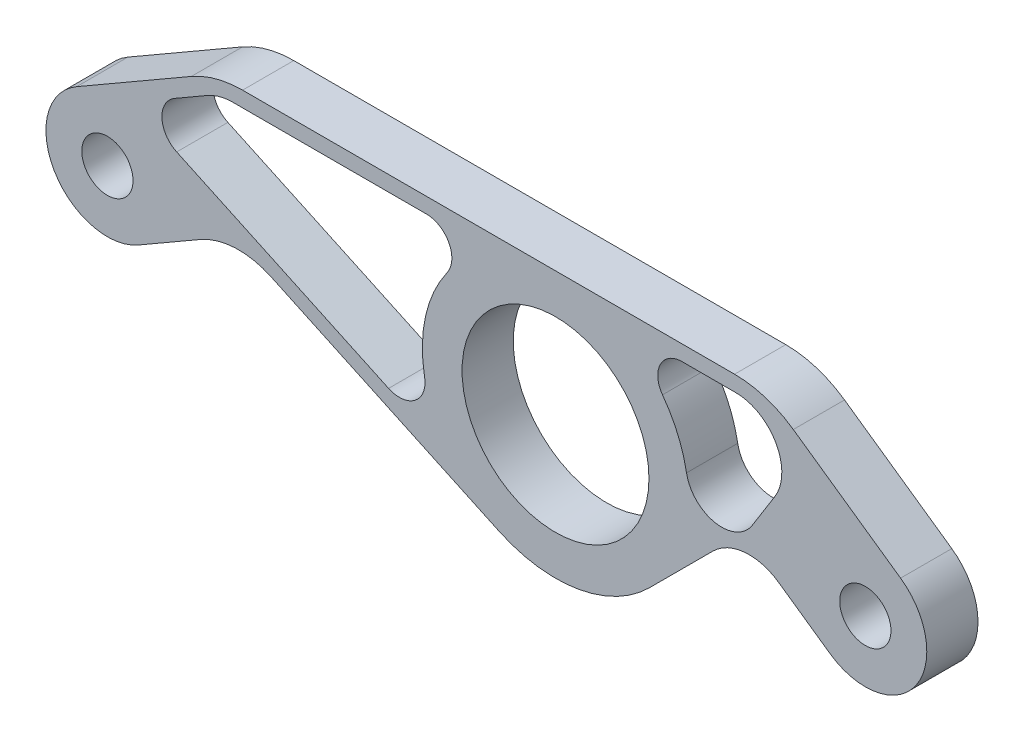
ISO-10303-21;
HEADER;
FILE_DESCRIPTION(('STEP AP214'),'2;1');
FILE_NAME('part.step','',(''),(''),'','','');
FILE_SCHEMA(('AUTOMOTIVE_DESIGN { 1 0 10303 214 1 1 1 1 }'));
ENDSEC;
DATA;
#1=APPLICATION_CONTEXT('core data for automotive mechanical design processes');
#2=APPLICATION_PROTOCOL_DEFINITION('international standard','automotive_design',2000,#1);
#3=PRODUCT_CONTEXT('',#1,'mechanical');
#4=PRODUCT('Part','Part','',(#3));
#5=PRODUCT_RELATED_PRODUCT_CATEGORY('part','',(#4));
#6=PRODUCT_DEFINITION_FORMATION('','',#4);
#7=PRODUCT_DEFINITION_CONTEXT('part definition',#1,'design');
#8=PRODUCT_DEFINITION('design','',#6,#7);
#9=PRODUCT_DEFINITION_SHAPE('','',#8);
#10=(LENGTH_UNIT() NAMED_UNIT(*) SI_UNIT(.MILLI.,.METRE.));
#11=(NAMED_UNIT(*) PLANE_ANGLE_UNIT() SI_UNIT($,.RADIAN.));
#12=(NAMED_UNIT(*) SI_UNIT($,.STERADIAN.) SOLID_ANGLE_UNIT());
#13=UNCERTAINTY_MEASURE_WITH_UNIT(LENGTH_MEASURE(1.E-05),#10,'distance_accuracy_value','');
#14=(GEOMETRIC_REPRESENTATION_CONTEXT(3) GLOBAL_UNCERTAINTY_ASSIGNED_CONTEXT((#13)) GLOBAL_UNIT_ASSIGNED_CONTEXT((#10,
#11,#12)) REPRESENTATION_CONTEXT('',''));
#15=CARTESIAN_POINT('',(0.,0.,0.));
#16=DIRECTION('',(0.,0.,1.));
#17=DIRECTION('',(1.,0.,0.));
#18=AXIS2_PLACEMENT_3D('',#15,#16,#17);
#19=CARTESIAN_POINT('',(-87.5,0.,10.));
#20=DIRECTION('',(0.,0.,-1.));
#21=DIRECTION('',(-1.,0.,0.));
#22=AXIS2_PLACEMENT_3D('',#19,#20,#21);
#23=PLANE('',#22);
#24=CARTESIAN_POINT('',(60.5,-2.11270655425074,10.));
#25=DIRECTION('',(0.,0.,1.));
#26=DIRECTION('',(1.,0.,0.));
#27=AXIS2_PLACEMENT_3D('',#24,#25,#26);
#28=CIRCLE('',#27,5.);
#29=CARTESIAN_POINT('',(65.5,-2.11270655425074,10.));
#30=VERTEX_POINT('',#29);
#31=EDGE_CURVE('E242',#30,#30,#28,.T.);
#32=ORIENTED_EDGE('',*,*,#31,.F.);
#33=EDGE_LOOP('',(#32));
#34=FACE_BOUND('',#33,.T.);
#35=CARTESIAN_POINT('',(-87.5,0.,10.));
#36=DIRECTION('',(0.,0.,-1.));
#37=DIRECTION('',(-1.,0.,0.));
#38=AXIS2_PLACEMENT_3D('',#35,#36,#37);
#39=CIRCLE('',#38,12.);
#40=CARTESIAN_POINT('',(-81.5,-10.3923048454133,10.));
#41=VERTEX_POINT('',#40);
#42=CARTESIAN_POINT('',(-93.5,10.3923048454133,10.));
#43=VERTEX_POINT('',#42);
#44=EDGE_CURVE('E348',#41,#43,#39,.T.);
#45=ORIENTED_EDGE('',*,*,#44,.F.);
#46=DIRECTION('',(-0.866025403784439,-0.499999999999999,0.));
#47=VECTOR('',#46,1.);
#48=CARTESIAN_POINT('',(-69.3782524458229,-3.39381063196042,10.));
#49=LINE('',#48,#47);
#50=CARTESIAN_POINT('',(-69.3782524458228,-3.39381063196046,10.));
#51=VERTEX_POINT('',#50);
#52=EDGE_CURVE('E385',#51,#41,#49,.T.);
#53=ORIENTED_EDGE('',*,*,#52,.F.);
#54=CARTESIAN_POINT('',(-61.8782524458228,-16.3841916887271,10.));
#55=DIRECTION('',(0.,0.,1.));
#56=DIRECTION('',(1.,0.,0.));
#57=AXIS2_PLACEMENT_3D('',#54,#55,#56);
#58=CIRCLE('',#57,15.);
#59=CARTESIAN_POINT('',(-55.5389785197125,-2.78957488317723,10.));
#60=VERTEX_POINT('',#59);
#61=EDGE_CURVE('E382',#60,#51,#58,.T.);
#62=ORIENTED_EDGE('',*,*,#61,.F.);
#63=DIRECTION('',(-0.906307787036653,0.422618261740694,0.));
#64=VECTOR('',#63,1.);
#65=CARTESIAN_POINT('',(-10.988074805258,-23.564002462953,10.));
#66=LINE('',#65,#64);
#67=CARTESIAN_POINT('',(-10.988074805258,-23.564002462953,10.));
#68=VERTEX_POINT('',#67);
#69=EDGE_CURVE('E379',#68,#60,#66,.T.);
#70=ORIENTED_EDGE('',*,*,#69,.F.);
#71=CARTESIAN_POINT('',(0.,0.,10.));
#72=DIRECTION('',(0.,0.,-1.));
#73=DIRECTION('',(-1.,0.,0.));
#74=AXIS2_PLACEMENT_3D('',#71,#72,#73);
#75=CIRCLE('',#74,26.);
#76=CARTESIAN_POINT('',(18.3847763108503,-18.3847763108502,10.));
#77=VERTEX_POINT('',#76);
#78=EDGE_CURVE('E376',#77,#68,#75,.T.);
#79=ORIENTED_EDGE('',*,*,#78,.F.);
#80=DIRECTION('',(-0.707106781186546,-0.707106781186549,0.));
#81=VECTOR('',#80,1.);
#82=CARTESIAN_POINT('',(30.7504894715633,-6.01906315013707,10.));
#83=LINE('',#82,#81);
#84=CARTESIAN_POINT('',(30.7504894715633,-6.01906315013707,10.));
#85=VERTEX_POINT('',#84);
#86=EDGE_CURVE('E373',#85,#77,#83,.T.);
#87=ORIENTED_EDGE('',*,*,#86,.F.);
#88=CARTESIAN_POINT('',(37.8215572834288,-13.0901309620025,10.));
#89=DIRECTION('',(0.,0.,1.));
#90=DIRECTION('',(1.,0.,0.));
#91=AXIS2_PLACEMENT_3D('',#88,#89,#90);
#92=CIRCLE('',#91,10.);
#93=CARTESIAN_POINT('',(43.5573216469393,-4.89861051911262,10.));
#94=VERTEX_POINT('',#93);
#95=EDGE_CURVE('E370',#94,#85,#92,.T.);
#96=ORIENTED_EDGE('',*,*,#95,.F.);
#97=DIRECTION('',(0.819152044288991,-0.573576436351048,0.));
#98=VECTOR('',#97,1.);
#99=CARTESIAN_POINT('',(43.5573216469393,-4.89861051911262,10.));
#100=LINE('',#99,#98);
#101=CARTESIAN_POINT('',(53.6170827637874,-11.9425310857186,10.));
#102=VERTEX_POINT('',#101);
#103=EDGE_CURVE('E368',#94,#102,#100,.T.);
#104=ORIENTED_EDGE('',*,*,#103,.T.);
#105=CARTESIAN_POINT('',(60.5,-2.11270655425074,10.));
#106=DIRECTION('',(0.,0.,-1.));
#107=DIRECTION('',(-1.,0.,0.));
#108=AXIS2_PLACEMENT_3D('',#105,#106,#107);
#109=CIRCLE('',#108,12.);
#110=CARTESIAN_POINT('',(67.3829172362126,7.71711797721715,10.));
#111=VERTEX_POINT('',#110);
#112=EDGE_CURVE('E365',#111,#102,#109,.T.);
#113=ORIENTED_EDGE('',*,*,#112,.F.);
#114=DIRECTION('',(0.819152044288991,-0.573576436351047,0.));
#115=VECTOR('',#114,1.);
#116=CARTESIAN_POINT('',(46.4378086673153,22.3830408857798,10.));
#117=LINE('',#116,#115);
#118=CARTESIAN_POINT('',(46.4378086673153,22.3830408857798,10.));
#119=VERTEX_POINT('',#118);
#120=EDGE_CURVE('E362',#119,#111,#117,.T.);
#121=ORIENTED_EDGE('',*,*,#120,.F.);
#122=CARTESIAN_POINT('',(34.9662799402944,6.,10.));
#123=DIRECTION('',(0.,0.,-1.));
#124=DIRECTION('',(-1.,0.,0.));
#125=AXIS2_PLACEMENT_3D('',#122,#123,#124);
#126=CIRCLE('',#125,20.);
#127=CARTESIAN_POINT('',(34.9662799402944,26.,10.));
#128=VERTEX_POINT('',#127);
#129=EDGE_CURVE('E359',#128,#119,#126,.T.);
#130=ORIENTED_EDGE('',*,*,#129,.F.);
#131=DIRECTION('',(1.,0.,0.));
#132=VECTOR('',#131,1.);
#133=CARTESIAN_POINT('',(-61.1076951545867,26.,10.));
#134=LINE('',#133,#132);
#135=CARTESIAN_POINT('',(-61.1076951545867,26.,10.));
#136=VERTEX_POINT('',#135);
#137=EDGE_CURVE('E356',#136,#128,#134,.T.);
#138=ORIENTED_EDGE('',*,*,#137,.F.);
#139=CARTESIAN_POINT('',(-61.1076951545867,6.,10.));
#140=DIRECTION('',(0.,0.,1.));
#141=DIRECTION('',(1.,0.,0.));
#142=AXIS2_PLACEMENT_3D('',#139,#140,#141);
#143=CIRCLE('',#142,20.);
#144=CARTESIAN_POINT('',(-71.1076951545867,23.3205080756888,10.));
#145=VERTEX_POINT('',#144);
#146=EDGE_CURVE('E354',#136,#145,#143,.T.);
#147=ORIENTED_EDGE('',*,*,#146,.T.);
#148=DIRECTION('',(-0.866025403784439,-0.499999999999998,0.));
#149=VECTOR('',#148,1.);
#150=CARTESIAN_POINT('',(-71.1076951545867,23.3205080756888,10.));
#151=LINE('',#150,#149);
#152=EDGE_CURVE('E351',#145,#43,#151,.T.);
#153=ORIENTED_EDGE('',*,*,#152,.T.);
#154=EDGE_LOOP('',(#45,#53,#62,#70,#79,#87,#96,#104,#113,#121,#130,#138,#147,#153));
#155=FACE_BOUND('',#154,.T.);
#156=CARTESIAN_POINT('',(-62.9833395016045,13.,10.));
#157=DIRECTION('',(0.,0.,1.));
#158=DIRECTION('',(1.,0.,0.));
#159=AXIS2_PLACEMENT_3D('',#156,#157,#158);
#160=CIRCLE('',#159,10.);
#161=CARTESIAN_POINT('',(-62.9833395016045,23.,10.));
#162=VERTEX_POINT('',#161);
#163=CARTESIAN_POINT('',(-67.9833395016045,21.6602540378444,10.));
#164=VERTEX_POINT('',#163);
#165=EDGE_CURVE('E311',#162,#164,#160,.T.);
#166=ORIENTED_EDGE('',*,*,#165,.F.);
#167=DIRECTION('',(-1.,0.,0.));
#168=VECTOR('',#167,1.);
#169=CARTESIAN_POINT('',(0.,23.,10.));
#170=LINE('',#169,#168);
#171=CARTESIAN_POINT('',(-25.2388589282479,23.,10.));
#172=VERTEX_POINT('',#171);
#173=EDGE_CURVE('E282',#172,#162,#170,.T.);
#174=ORIENTED_EDGE('',*,*,#173,.F.);
#175=CARTESIAN_POINT('',(-25.2388589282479,18.,10.));
#176=DIRECTION('',(0.,0.,1.));
#177=DIRECTION('',(1.,0.,0.));
#178=AXIS2_PLACEMENT_3D('',#175,#176,#177);
#179=CIRCLE('',#178,5.);
#180=CARTESIAN_POINT('',(-21.1680752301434,15.0967741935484,10.));
#181=VERTEX_POINT('',#180);
#182=EDGE_CURVE('E289',#181,#172,#179,.T.);
#183=ORIENTED_EDGE('',*,*,#182,.F.);
#184=CARTESIAN_POINT('',(0.,0.,10.));
#185=DIRECTION('',(0.,0.,1.));
#186=DIRECTION('',(1.,0.,0.));
#187=AXIS2_PLACEMENT_3D('',#184,#185,#186);
#188=CIRCLE('',#187,26.);
#189=CARTESIAN_POINT('',(-25.5649638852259,-4.73630885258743,10.));
#190=VERTEX_POINT('',#189);
#191=EDGE_CURVE('E326',#181,#190,#188,.T.);
#192=ORIENTED_EDGE('',*,*,#191,.T.);
#193=CARTESIAN_POINT('',(-30.4813030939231,-5.64713747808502,10.));
#194=DIRECTION('',(0.,0.,1.));
#195=DIRECTION('',(1.,0.,0.));
#196=AXIS2_PLACEMENT_3D('',#193,#194,#195);
#197=CIRCLE('',#196,5.);
#198=CARTESIAN_POINT('',(-32.5943944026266,-10.1786764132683,10.));
#199=VERTEX_POINT('',#198);
#200=EDGE_CURVE('E323',#199,#190,#197,.T.);
#201=ORIENTED_EDGE('',*,*,#200,.F.);
#202=DIRECTION('',(0.906307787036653,-0.422618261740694,0.));
#203=VECTOR('',#202,1.);
#204=CARTESIAN_POINT('',(-9.72022002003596,-20.845079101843,10.));
#205=LINE('',#204,#203);
#206=CARTESIAN_POINT('',(-73.9735652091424,9.11674782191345,10.));
#207=VERTEX_POINT('',#206);
#208=EDGE_CURVE('E320',#207,#199,#205,.T.);
#209=ORIENTED_EDGE('',*,*,#208,.F.);
#210=CARTESIAN_POINT('',(-71.8604739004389,13.6482867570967,10.));
#211=DIRECTION('',(0.,0.,1.));
#212=DIRECTION('',(1.,0.,0.));
#213=AXIS2_PLACEMENT_3D('',#210,#211,#212);
#214=CIRCLE('',#213,5.);
#215=CARTESIAN_POINT('',(-74.3604739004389,17.9784137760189,10.));
#216=VERTEX_POINT('',#215);
#217=EDGE_CURVE('E317',#216,#207,#214,.T.);
#218=ORIENTED_EDGE('',*,*,#217,.F.);
#219=DIRECTION('',(-0.866025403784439,-0.5,0.));
#220=VECTOR('',#219,1.);
#221=CARTESIAN_POINT('',(-26.375,45.6828400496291,10.));
#222=LINE('',#221,#220);
#223=EDGE_CURVE('E314',#164,#216,#222,.T.);
#224=ORIENTED_EDGE('',*,*,#223,.F.);
#225=EDGE_LOOP('',(#166,#174,#183,#192,#201,#209,#218,#224));
#226=FACE_BOUND('',#225,.T.);
#227=CARTESIAN_POINT('',(-87.5,0.,10.));
#228=DIRECTION('',(0.,0.,1.));
#229=DIRECTION('',(1.,0.,0.));
#230=AXIS2_PLACEMENT_3D('',#227,#228,#229);
#231=CIRCLE('',#230,5.);
#232=CARTESIAN_POINT('',(-82.5,0.,10.));
#233=VERTEX_POINT('',#232);
#234=EDGE_CURVE('E276',#233,#233,#231,.T.);
#235=ORIENTED_EDGE('',*,*,#234,.F.);
#236=EDGE_LOOP('',(#235));
#237=FACE_BOUND('',#236,.T.);
#238=CARTESIAN_POINT('',(0.,0.,10.));
#239=DIRECTION('',(0.,0.,1.));
#240=DIRECTION('',(1.,0.,0.));
#241=AXIS2_PLACEMENT_3D('',#238,#239,#240);
#242=CIRCLE('',#241,18.25);
#243=CARTESIAN_POINT('',(18.25,0.,10.));
#244=VERTEX_POINT('',#243);
#245=EDGE_CURVE('E265',#244,#244,#242,.T.);
#246=ORIENTED_EDGE('',*,*,#245,.F.);
#247=EDGE_LOOP('',(#246));
#248=FACE_BOUND('',#247,.T.);
#249=CARTESIAN_POINT('',(0.,0.,10.));
#250=DIRECTION('',(0.,0.,1.));
#251=DIRECTION('',(1.,0.,0.));
#252=AXIS2_PLACEMENT_3D('',#249,#250,#251);
#253=CIRCLE('',#252,26.);
#254=CARTESIAN_POINT('',(25.5853253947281,4.62505399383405,10.));
#255=VERTEX_POINT('',#254);
#256=CARTESIAN_POINT('',(20.8901553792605,15.4790635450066,10.));
#257=VERTEX_POINT('',#256);
#258=EDGE_CURVE('E50',#255,#257,#253,.T.);
#259=ORIENTED_EDGE('',*,*,#258,.T.);
#260=CARTESIAN_POINT('',(24.6779345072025,18.2857096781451,10.));
#261=DIRECTION('',(0.,0.,1.));
#262=DIRECTION('',(1.,0.,0.));
#263=AXIS2_PLACEMENT_3D('',#260,#261,#262);
#264=CIRCLE('',#263,4.71429032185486);
#265=CARTESIAN_POINT('',(24.6779345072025,23.,10.));
#266=VERTEX_POINT('',#265);
#267=EDGE_CURVE('E236',#257,#266,#264,.F.);
#268=ORIENTED_EDGE('',*,*,#267,.T.);
#269=DIRECTION('',(1.,0.,0.));
#270=VECTOR('',#269,1.);
#271=CARTESIAN_POINT('',(0.,23.,10.));
#272=LINE('',#271,#270);
#273=CARTESIAN_POINT('',(35.1929090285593,23.,10.));
#274=VERTEX_POINT('',#273);
#275=EDGE_CURVE('E239',#266,#274,#272,.T.);
#276=ORIENTED_EDGE('',*,*,#275,.T.);
#277=CARTESIAN_POINT('',(35.1929090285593,14.,10.));
#278=DIRECTION('',(0.,0.,1.));
#279=DIRECTION('',(1.,0.,0.));
#280=AXIS2_PLACEMENT_3D('',#277,#278,#279);
#281=CIRCLE('',#280,9.);
#282=CARTESIAN_POINT('',(42.8265261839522,9.23262240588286,10.));
#283=VERTEX_POINT('',#282);
#284=EDGE_CURVE('E258',#274,#283,#281,.F.);
#285=ORIENTED_EDGE('',*,*,#284,.T.);
#286=DIRECTION('',(-0.529708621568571,-0.848179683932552,0.));
#287=VECTOR('',#286,1.);
#288=CARTESIAN_POINT('',(26.6616714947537,-16.6508553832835,10.));
#289=LINE('',#288,#287);
#290=CARTESIAN_POINT('',(38.4109400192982,2.16230048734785,10.));
#291=VERTEX_POINT('',#290);
#292=EDGE_CURVE('E255',#283,#291,#289,.T.);
#293=ORIENTED_EDGE('',*,*,#292,.T.);
#294=CARTESIAN_POINT('',(32.4736822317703,5.87026083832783,10.));
#295=DIRECTION('',(0.,0.,1.));
#296=DIRECTION('',(1.,0.,0.));
#297=AXIS2_PLACEMENT_3D('',#294,#295,#296);
#298=CIRCLE('',#297,6.99999999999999);
#299=EDGE_CURVE('E252',#291,#255,#298,.F.);
#300=ORIENTED_EDGE('',*,*,#299,.T.);
#301=EDGE_LOOP('',(#259,#268,#276,#285,#293,#300));
#302=FACE_BOUND('',#301,.T.);
#303=ADVANCED_FACE('F33',(#34,#155,#226,#237,#248,#302),#23,.F.);
#304=CARTESIAN_POINT('',(-87.5,0.,0.));
#305=DIRECTION('',(0.,0.,-1.));
#306=DIRECTION('',(-1.,0.,0.));
#307=AXIS2_PLACEMENT_3D('',#304,#305,#306);
#308=PLANE('',#307);
#309=CARTESIAN_POINT('',(60.5,-2.11270655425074,0.));
#310=DIRECTION('',(0.,0.,1.));
#311=DIRECTION('',(1.,0.,0.));
#312=AXIS2_PLACEMENT_3D('',#309,#310,#311);
#313=CIRCLE('',#312,5.);
#314=CARTESIAN_POINT('',(65.5,-2.11270655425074,0.));
#315=VERTEX_POINT('',#314);
#316=EDGE_CURVE('E253',#315,#315,#313,.T.);
#317=ORIENTED_EDGE('',*,*,#316,.T.);
#318=EDGE_LOOP('',(#317));
#319=FACE_BOUND('',#318,.T.);
#320=CARTESIAN_POINT('',(-87.5,0.,0.));
#321=DIRECTION('',(0.,0.,-1.));
#322=DIRECTION('',(-1.,0.,0.));
#323=AXIS2_PLACEMENT_3D('',#320,#321,#322);
#324=CIRCLE('',#323,12.);
#325=CARTESIAN_POINT('',(-81.5,-10.3923048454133,0.));
#326=VERTEX_POINT('',#325);
#327=CARTESIAN_POINT('',(-93.5,10.3923048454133,0.));
#328=VERTEX_POINT('',#327);
#329=EDGE_CURVE('E333',#326,#328,#324,.T.);
#330=ORIENTED_EDGE('',*,*,#329,.T.);
#331=DIRECTION('',(-0.866025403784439,-0.499999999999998,0.));
#332=VECTOR('',#331,1.);
#333=CARTESIAN_POINT('',(-71.1076951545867,23.3205080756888,0.));
#334=LINE('',#333,#332);
#335=CARTESIAN_POINT('',(-71.1076951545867,23.3205080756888,0.));
#336=VERTEX_POINT('',#335);
#337=EDGE_CURVE('E390',#336,#328,#334,.T.);
#338=ORIENTED_EDGE('',*,*,#337,.F.);
#339=CARTESIAN_POINT('',(-61.1076951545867,6.,0.));
#340=DIRECTION('',(0.,0.,1.));
#341=DIRECTION('',(1.,0.,0.));
#342=AXIS2_PLACEMENT_3D('',#339,#340,#341);
#343=CIRCLE('',#342,20.);
#344=CARTESIAN_POINT('',(-61.1076951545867,26.,0.));
#345=VERTEX_POINT('',#344);
#346=EDGE_CURVE('E393',#345,#336,#343,.T.);
#347=ORIENTED_EDGE('',*,*,#346,.F.);
#348=DIRECTION('',(1.,0.,0.));
#349=VECTOR('',#348,1.);
#350=CARTESIAN_POINT('',(-61.1076951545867,26.,0.));
#351=LINE('',#350,#349);
#352=CARTESIAN_POINT('',(34.9662799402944,26.,0.));
#353=VERTEX_POINT('',#352);
#354=EDGE_CURVE('E395',#345,#353,#351,.T.);
#355=ORIENTED_EDGE('',*,*,#354,.T.);
#356=CARTESIAN_POINT('',(34.9662799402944,6.,0.));
#357=DIRECTION('',(0.,0.,-1.));
#358=DIRECTION('',(-1.,0.,0.));
#359=AXIS2_PLACEMENT_3D('',#356,#357,#358);
#360=CIRCLE('',#359,20.);
#361=CARTESIAN_POINT('',(46.4378086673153,22.3830408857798,0.));
#362=VERTEX_POINT('',#361);
#363=EDGE_CURVE('E398',#353,#362,#360,.T.);
#364=ORIENTED_EDGE('',*,*,#363,.T.);
#365=DIRECTION('',(0.819152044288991,-0.573576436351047,0.));
#366=VECTOR('',#365,1.);
#367=CARTESIAN_POINT('',(46.4378086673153,22.3830408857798,0.));
#368=LINE('',#367,#366);
#369=CARTESIAN_POINT('',(67.3829172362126,7.71711797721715,0.));
#370=VERTEX_POINT('',#369);
#371=EDGE_CURVE('E401',#362,#370,#368,.T.);
#372=ORIENTED_EDGE('',*,*,#371,.T.);
#373=CARTESIAN_POINT('',(60.5,-2.11270655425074,0.));
#374=DIRECTION('',(0.,0.,-1.));
#375=DIRECTION('',(-1.,0.,0.));
#376=AXIS2_PLACEMENT_3D('',#373,#374,#375);
#377=CIRCLE('',#376,12.);
#378=CARTESIAN_POINT('',(53.6170827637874,-11.9425310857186,0.));
#379=VERTEX_POINT('',#378);
#380=EDGE_CURVE('E404',#370,#379,#377,.T.);
#381=ORIENTED_EDGE('',*,*,#380,.T.);
#382=DIRECTION('',(0.819152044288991,-0.573576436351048,0.));
#383=VECTOR('',#382,1.);
#384=CARTESIAN_POINT('',(43.5573216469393,-4.89861051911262,0.));
#385=LINE('',#384,#383);
#386=CARTESIAN_POINT('',(43.5573216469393,-4.89861051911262,0.));
#387=VERTEX_POINT('',#386);
#388=EDGE_CURVE('E407',#387,#379,#385,.T.);
#389=ORIENTED_EDGE('',*,*,#388,.F.);
#390=CARTESIAN_POINT('',(37.8215572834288,-13.0901309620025,0.));
#391=DIRECTION('',(0.,0.,1.));
#392=DIRECTION('',(1.,0.,0.));
#393=AXIS2_PLACEMENT_3D('',#390,#391,#392);
#394=CIRCLE('',#393,10.);
#395=CARTESIAN_POINT('',(30.7504894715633,-6.01906315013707,0.));
#396=VERTEX_POINT('',#395);
#397=EDGE_CURVE('E410',#387,#396,#394,.T.);
#398=ORIENTED_EDGE('',*,*,#397,.T.);
#399=DIRECTION('',(-0.707106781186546,-0.707106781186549,0.));
#400=VECTOR('',#399,1.);
#401=CARTESIAN_POINT('',(30.7504894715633,-6.01906315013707,0.));
#402=LINE('',#401,#400);
#403=CARTESIAN_POINT('',(18.3847763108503,-18.3847763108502,0.));
#404=VERTEX_POINT('',#403);
#405=EDGE_CURVE('E413',#396,#404,#402,.T.);
#406=ORIENTED_EDGE('',*,*,#405,.T.);
#407=CARTESIAN_POINT('',(0.,0.,0.));
#408=DIRECTION('',(0.,0.,-1.));
#409=DIRECTION('',(-1.,0.,0.));
#410=AXIS2_PLACEMENT_3D('',#407,#408,#409);
#411=CIRCLE('',#410,26.);
#412=CARTESIAN_POINT('',(-10.988074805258,-23.564002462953,0.));
#413=VERTEX_POINT('',#412);
#414=EDGE_CURVE('E416',#404,#413,#411,.T.);
#415=ORIENTED_EDGE('',*,*,#414,.T.);
#416=DIRECTION('',(-0.906307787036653,0.422618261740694,0.));
#417=VECTOR('',#416,1.);
#418=CARTESIAN_POINT('',(-10.988074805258,-23.564002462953,0.));
#419=LINE('',#418,#417);
#420=CARTESIAN_POINT('',(-55.5389785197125,-2.78957488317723,0.));
#421=VERTEX_POINT('',#420);
#422=EDGE_CURVE('E419',#413,#421,#419,.T.);
#423=ORIENTED_EDGE('',*,*,#422,.T.);
#424=CARTESIAN_POINT('',(-61.8782524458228,-16.3841916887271,0.));
#425=DIRECTION('',(0.,0.,1.));
#426=DIRECTION('',(1.,0.,0.));
#427=AXIS2_PLACEMENT_3D('',#424,#425,#426);
#428=CIRCLE('',#427,15.);
#429=CARTESIAN_POINT('',(-69.3782524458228,-3.39381063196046,0.));
#430=VERTEX_POINT('',#429);
#431=EDGE_CURVE('E422',#421,#430,#428,.T.);
#432=ORIENTED_EDGE('',*,*,#431,.T.);
#433=DIRECTION('',(-0.866025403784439,-0.499999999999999,0.));
#434=VECTOR('',#433,1.);
#435=CARTESIAN_POINT('',(-69.3782524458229,-3.39381063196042,0.));
#436=LINE('',#435,#434);
#437=EDGE_CURVE('E352',#430,#326,#436,.T.);
#438=ORIENTED_EDGE('',*,*,#437,.T.);
#439=EDGE_LOOP('',(#330,#338,#347,#355,#364,#372,#381,#389,#398,#406,#415,#423,#432,#438));
#440=FACE_BOUND('',#439,.T.);
#441=DIRECTION('',(-1.,0.,0.));
#442=VECTOR('',#441,1.);
#443=CARTESIAN_POINT('',(0.,23.,0.));
#444=LINE('',#443,#442);
#445=CARTESIAN_POINT('',(-25.2388589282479,23.,0.));
#446=VERTEX_POINT('',#445);
#447=CARTESIAN_POINT('',(-62.9833395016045,23.,0.));
#448=VERTEX_POINT('',#447);
#449=EDGE_CURVE('E285',#446,#448,#444,.T.);
#450=ORIENTED_EDGE('',*,*,#449,.T.);
#451=CARTESIAN_POINT('',(-62.9833395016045,13.,0.));
#452=DIRECTION('',(0.,0.,1.));
#453=DIRECTION('',(1.,0.,0.));
#454=AXIS2_PLACEMENT_3D('',#451,#452,#453);
#455=CIRCLE('',#454,10.);
#456=CARTESIAN_POINT('',(-67.9833395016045,21.6602540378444,0.));
#457=VERTEX_POINT('',#456);
#458=EDGE_CURVE('E288',#448,#457,#455,.T.);
#459=ORIENTED_EDGE('',*,*,#458,.T.);
#460=DIRECTION('',(-0.866025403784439,-0.5,0.));
#461=VECTOR('',#460,1.);
#462=CARTESIAN_POINT('',(-26.375,45.6828400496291,0.));
#463=LINE('',#462,#461);
#464=CARTESIAN_POINT('',(-74.3604739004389,17.9784137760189,0.));
#465=VERTEX_POINT('',#464);
#466=EDGE_CURVE('E292',#457,#465,#463,.T.);
#467=ORIENTED_EDGE('',*,*,#466,.T.);
#468=CARTESIAN_POINT('',(-71.8604739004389,13.6482867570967,0.));
#469=DIRECTION('',(0.,0.,1.));
#470=DIRECTION('',(1.,0.,0.));
#471=AXIS2_PLACEMENT_3D('',#468,#469,#470);
#472=CIRCLE('',#471,5.);
#473=CARTESIAN_POINT('',(-73.9735652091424,9.11674782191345,0.));
#474=VERTEX_POINT('',#473);
#475=EDGE_CURVE('E295',#465,#474,#472,.T.);
#476=ORIENTED_EDGE('',*,*,#475,.T.);
#477=DIRECTION('',(0.906307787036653,-0.422618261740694,0.));
#478=VECTOR('',#477,1.);
#479=CARTESIAN_POINT('',(-9.72022002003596,-20.845079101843,0.));
#480=LINE('',#479,#478);
#481=CARTESIAN_POINT('',(-32.5943944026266,-10.1786764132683,0.));
#482=VERTEX_POINT('',#481);
#483=EDGE_CURVE('E298',#474,#482,#480,.T.);
#484=ORIENTED_EDGE('',*,*,#483,.T.);
#485=CARTESIAN_POINT('',(-30.4813030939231,-5.64713747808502,0.));
#486=DIRECTION('',(0.,0.,1.));
#487=DIRECTION('',(1.,0.,0.));
#488=AXIS2_PLACEMENT_3D('',#485,#486,#487);
#489=CIRCLE('',#488,5.);
#490=CARTESIAN_POINT('',(-25.5649638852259,-4.73630885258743,0.));
#491=VERTEX_POINT('',#490);
#492=EDGE_CURVE('E301',#482,#491,#489,.T.);
#493=ORIENTED_EDGE('',*,*,#492,.T.);
#494=CARTESIAN_POINT('',(0.,0.,0.));
#495=DIRECTION('',(0.,0.,1.));
#496=DIRECTION('',(1.,0.,0.));
#497=AXIS2_PLACEMENT_3D('',#494,#495,#496);
#498=CIRCLE('',#497,26.);
#499=CARTESIAN_POINT('',(-21.1680752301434,15.0967741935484,0.));
#500=VERTEX_POINT('',#499);
#501=EDGE_CURVE('E304',#500,#491,#498,.T.);
#502=ORIENTED_EDGE('',*,*,#501,.F.);
#503=CARTESIAN_POINT('',(-25.2388589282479,18.,0.));
#504=DIRECTION('',(0.,0.,1.));
#505=DIRECTION('',(1.,0.,0.));
#506=AXIS2_PLACEMENT_3D('',#503,#504,#505);
#507=CIRCLE('',#506,5.);
#508=EDGE_CURVE('E306',#500,#446,#507,.T.);
#509=ORIENTED_EDGE('',*,*,#508,.T.);
#510=EDGE_LOOP('',(#450,#459,#467,#476,#484,#493,#502,#509));
#511=FACE_BOUND('',#510,.T.);
#512=CARTESIAN_POINT('',(-87.5,0.,0.));
#513=DIRECTION('',(0.,0.,1.));
#514=DIRECTION('',(1.,0.,0.));
#515=AXIS2_PLACEMENT_3D('',#512,#513,#514);
#516=CIRCLE('',#515,5.);
#517=CARTESIAN_POINT('',(-82.5,0.,0.));
#518=VERTEX_POINT('',#517);
#519=EDGE_CURVE('E279',#518,#518,#516,.T.);
#520=ORIENTED_EDGE('',*,*,#519,.T.);
#521=EDGE_LOOP('',(#520));
#522=FACE_BOUND('',#521,.T.);
#523=CARTESIAN_POINT('',(0.,0.,0.));
#524=DIRECTION('',(0.,0.,1.));
#525=DIRECTION('',(1.,0.,0.));
#526=AXIS2_PLACEMENT_3D('',#523,#524,#525);
#527=CIRCLE('',#526,18.25);
#528=CARTESIAN_POINT('',(18.25,0.,0.));
#529=VERTEX_POINT('',#528);
#530=EDGE_CURVE('E273',#529,#529,#527,.T.);
#531=ORIENTED_EDGE('',*,*,#530,.T.);
#532=EDGE_LOOP('',(#531));
#533=FACE_BOUND('',#532,.T.);
#534=CARTESIAN_POINT('',(24.6779345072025,18.2857096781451,0.));
#535=DIRECTION('',(0.,0.,1.));
#536=DIRECTION('',(1.,0.,0.));
#537=AXIS2_PLACEMENT_3D('',#534,#535,#536);
#538=CIRCLE('',#537,4.71429032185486);
#539=CARTESIAN_POINT('',(20.8901553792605,15.4790635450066,0.));
#540=VERTEX_POINT('',#539);
#541=CARTESIAN_POINT('',(24.6779345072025,23.,0.));
#542=VERTEX_POINT('',#541);
#543=EDGE_CURVE('E231',#540,#542,#538,.F.);
#544=ORIENTED_EDGE('',*,*,#543,.F.);
#545=CARTESIAN_POINT('',(0.,0.,0.));
#546=DIRECTION('',(0.,0.,1.));
#547=DIRECTION('',(1.,0.,0.));
#548=AXIS2_PLACEMENT_3D('',#545,#546,#547);
#549=CIRCLE('',#548,26.);
#550=CARTESIAN_POINT('',(25.5853253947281,4.62505399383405,0.));
#551=VERTEX_POINT('',#550);
#552=EDGE_CURVE('E227',#551,#540,#549,.T.);
#553=ORIENTED_EDGE('',*,*,#552,.F.);
#554=CARTESIAN_POINT('',(32.4736822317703,5.87026083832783,0.));
#555=DIRECTION('',(0.,0.,1.));
#556=DIRECTION('',(1.,0.,0.));
#557=AXIS2_PLACEMENT_3D('',#554,#555,#556);
#558=CIRCLE('',#557,6.99999999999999);
#559=CARTESIAN_POINT('',(38.4109400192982,2.16230048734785,0.));
#560=VERTEX_POINT('',#559);
#561=EDGE_CURVE('E219',#560,#551,#558,.F.);
#562=ORIENTED_EDGE('',*,*,#561,.F.);
#563=DIRECTION('',(-0.529708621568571,-0.848179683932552,0.));
#564=VECTOR('',#563,1.);
#565=CARTESIAN_POINT('',(26.6616714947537,-16.6508553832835,0.));
#566=LINE('',#565,#564);
#567=CARTESIAN_POINT('',(42.8265261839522,9.23262240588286,0.));
#568=VERTEX_POINT('',#567);
#569=EDGE_CURVE('E226',#568,#560,#566,.T.);
#570=ORIENTED_EDGE('',*,*,#569,.F.);
#571=CARTESIAN_POINT('',(35.1929090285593,14.,0.));
#572=DIRECTION('',(0.,0.,1.));
#573=DIRECTION('',(1.,0.,0.));
#574=AXIS2_PLACEMENT_3D('',#571,#572,#573);
#575=CIRCLE('',#574,9.);
#576=CARTESIAN_POINT('',(35.1929090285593,23.,0.));
#577=VERTEX_POINT('',#576);
#578=EDGE_CURVE('E246',#577,#568,#575,.F.);
#579=ORIENTED_EDGE('',*,*,#578,.F.);
#580=DIRECTION('',(1.,0.,0.));
#581=VECTOR('',#580,1.);
#582=CARTESIAN_POINT('',(0.,23.,0.));
#583=LINE('',#582,#581);
#584=EDGE_CURVE('E248',#542,#577,#583,.T.);
#585=ORIENTED_EDGE('',*,*,#584,.F.);
#586=EDGE_LOOP('',(#544,#553,#562,#570,#579,#585));
#587=FACE_BOUND('',#586,.T.);
#588=ADVANCED_FACE('F234',(#319,#440,#511,#522,#533,#587),#308,.T.);
#589=CARTESIAN_POINT('',(-87.5,0.,10.));
#590=DIRECTION('',(0.,0.,-1.));
#591=DIRECTION('',(-1.,0.,0.));
#592=AXIS2_PLACEMENT_3D('',#589,#590,#591);
#593=CYLINDRICAL_SURFACE('',#592,12.);
#594=ORIENTED_EDGE('',*,*,#329,.F.);
#595=DIRECTION('',(0.,0.,-1.));
#596=VECTOR('',#595,1.);
#597=CARTESIAN_POINT('',(-81.5,-10.3923048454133,10.));
#598=LINE('',#597,#596);
#599=EDGE_CURVE('E11',#41,#326,#598,.T.);
#600=ORIENTED_EDGE('',*,*,#599,.F.);
#601=ORIENTED_EDGE('',*,*,#44,.T.);
#602=DIRECTION('',(0.,0.,-1.));
#603=VECTOR('',#602,1.);
#604=CARTESIAN_POINT('',(-93.5,10.3923048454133,10.));
#605=LINE('',#604,#603);
#606=EDGE_CURVE('E37',#43,#328,#605,.T.);
#607=ORIENTED_EDGE('',*,*,#606,.T.);
#608=EDGE_LOOP('',(#594,#600,#601,#607));
#609=FACE_BOUND('',#608,.T.);
#610=ADVANCED_FACE('F35',(#609),#593,.T.);
#611=CARTESIAN_POINT('',(-69.3782524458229,-3.39381063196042,10.));
#612=DIRECTION('',(0.499999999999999,-0.866025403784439,0.));
#613=DIRECTION('',(0.866025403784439,0.499999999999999,0.));
#614=AXIS2_PLACEMENT_3D('',#611,#612,#613);
#615=PLANE('',#614);
#616=ORIENTED_EDGE('',*,*,#437,.F.);
#617=DIRECTION('',(0.,0.,-1.));
#618=VECTOR('',#617,1.);
#619=CARTESIAN_POINT('',(-69.3782524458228,-3.39381063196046,10.));
#620=LINE('',#619,#618);
#621=EDGE_CURVE('E42',#51,#430,#620,.T.);
#622=ORIENTED_EDGE('',*,*,#621,.F.);
#623=ORIENTED_EDGE('',*,*,#52,.T.);
#624=ORIENTED_EDGE('',*,*,#599,.T.);
#625=EDGE_LOOP('',(#616,#622,#623,#624));
#626=FACE_BOUND('',#625,.T.);
#627=ADVANCED_FACE('F464',(#626),#615,.T.);
#628=CARTESIAN_POINT('',(-61.8782524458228,-16.3841916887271,10.));
#629=DIRECTION('',(0.,0.,-1.));
#630=DIRECTION('',(-1.,0.,0.));
#631=AXIS2_PLACEMENT_3D('',#628,#629,#630);
#632=CYLINDRICAL_SURFACE('',#631,15.);
#633=ORIENTED_EDGE('',*,*,#431,.F.);
#634=DIRECTION('',(0.,0.,-1.));
#635=VECTOR('',#634,1.);
#636=CARTESIAN_POINT('',(-55.5389785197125,-2.78957488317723,10.));
#637=LINE('',#636,#635);
#638=EDGE_CURVE('E428',#60,#421,#637,.T.);
#639=ORIENTED_EDGE('',*,*,#638,.F.);
#640=ORIENTED_EDGE('',*,*,#61,.T.);
#641=ORIENTED_EDGE('',*,*,#621,.T.);
#642=EDGE_LOOP('',(#633,#639,#640,#641));
#643=FACE_BOUND('',#642,.T.);
#644=ADVANCED_FACE('F510',(#643),#632,.F.);
#645=CARTESIAN_POINT('',(-10.988074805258,-23.564002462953,10.));
#646=DIRECTION('',(-0.422618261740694,-0.906307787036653,0.));
#647=DIRECTION('',(0.906307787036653,-0.422618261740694,0.));
#648=AXIS2_PLACEMENT_3D('',#645,#646,#647);
#649=PLANE('',#648);
#650=ORIENTED_EDGE('',*,*,#422,.F.);
#651=DIRECTION('',(0.,0.,-1.));
#652=VECTOR('',#651,1.);
#653=CARTESIAN_POINT('',(-10.988074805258,-23.564002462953,10.));
#654=LINE('',#653,#652);
#655=EDGE_CURVE('E430',#68,#413,#654,.T.);
#656=ORIENTED_EDGE('',*,*,#655,.F.);
#657=ORIENTED_EDGE('',*,*,#69,.T.);
#658=ORIENTED_EDGE('',*,*,#638,.T.);
#659=EDGE_LOOP('',(#650,#656,#657,#658));
#660=FACE_BOUND('',#659,.T.);
#661=ADVANCED_FACE('F508',(#660),#649,.T.);
#662=CARTESIAN_POINT('',(0.,0.,10.));
#663=DIRECTION('',(0.,0.,-1.));
#664=DIRECTION('',(-1.,0.,0.));
#665=AXIS2_PLACEMENT_3D('',#662,#663,#664);
#666=CYLINDRICAL_SURFACE('',#665,26.);
#667=ORIENTED_EDGE('',*,*,#414,.F.);
#668=DIRECTION('',(0.,0.,-1.));
#669=VECTOR('',#668,1.);
#670=CARTESIAN_POINT('',(18.3847763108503,-18.3847763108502,10.));
#671=LINE('',#670,#669);
#672=EDGE_CURVE('E432',#77,#404,#671,.T.);
#673=ORIENTED_EDGE('',*,*,#672,.F.);
#674=ORIENTED_EDGE('',*,*,#78,.T.);
#675=ORIENTED_EDGE('',*,*,#655,.T.);
#676=EDGE_LOOP('',(#667,#673,#674,#675));
#677=FACE_BOUND('',#676,.T.);
#678=ADVANCED_FACE('F504',(#677),#666,.T.);
#679=CARTESIAN_POINT('',(30.7504894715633,-6.01906315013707,10.));
#680=DIRECTION('',(0.707106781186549,-0.707106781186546,0.));
#681=DIRECTION('',(0.707106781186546,0.707106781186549,0.));
#682=AXIS2_PLACEMENT_3D('',#679,#680,#681);
#683=PLANE('',#682);
#684=ORIENTED_EDGE('',*,*,#405,.F.);
#685=DIRECTION('',(0.,0.,-1.));
#686=VECTOR('',#685,1.);
#687=CARTESIAN_POINT('',(30.7504894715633,-6.01906315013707,10.));
#688=LINE('',#687,#686);
#689=EDGE_CURVE('E434',#85,#396,#688,.T.);
#690=ORIENTED_EDGE('',*,*,#689,.F.);
#691=ORIENTED_EDGE('',*,*,#86,.T.);
#692=ORIENTED_EDGE('',*,*,#672,.T.);
#693=EDGE_LOOP('',(#684,#690,#691,#692));
#694=FACE_BOUND('',#693,.T.);
#695=ADVANCED_FACE('F500',(#694),#683,.T.);
#696=CARTESIAN_POINT('',(37.8215572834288,-13.0901309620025,10.));
#697=DIRECTION('',(0.,0.,-1.));
#698=DIRECTION('',(-1.,0.,0.));
#699=AXIS2_PLACEMENT_3D('',#696,#697,#698);
#700=CYLINDRICAL_SURFACE('',#699,10.);
#701=ORIENTED_EDGE('',*,*,#397,.F.);
#702=DIRECTION('',(0.,0.,-1.));
#703=VECTOR('',#702,1.);
#704=CARTESIAN_POINT('',(43.5573216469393,-4.89861051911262,10.));
#705=LINE('',#704,#703);
#706=EDGE_CURVE('E436',#94,#387,#705,.T.);
#707=ORIENTED_EDGE('',*,*,#706,.F.);
#708=ORIENTED_EDGE('',*,*,#95,.T.);
#709=ORIENTED_EDGE('',*,*,#689,.T.);
#710=EDGE_LOOP('',(#701,#707,#708,#709));
#711=FACE_BOUND('',#710,.T.);
#712=ADVANCED_FACE('F495',(#711),#700,.F.);
#713=CARTESIAN_POINT('',(43.5573216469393,-4.89861051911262,10.));
#714=DIRECTION('',(0.573576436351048,0.819152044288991,0.));
#715=DIRECTION('',(-0.819152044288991,0.573576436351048,0.));
#716=AXIS2_PLACEMENT_3D('',#713,#714,#715);
#717=PLANE('',#716);
#718=ORIENTED_EDGE('',*,*,#388,.T.);
#719=DIRECTION('',(0.,0.,-1.));
#720=VECTOR('',#719,1.);
#721=CARTESIAN_POINT('',(53.6170827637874,-11.9425310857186,10.));
#722=LINE('',#721,#720);
#723=EDGE_CURVE('E438',#102,#379,#722,.T.);
#724=ORIENTED_EDGE('',*,*,#723,.F.);
#725=ORIENTED_EDGE('',*,*,#103,.F.);
#726=ORIENTED_EDGE('',*,*,#706,.T.);
#727=EDGE_LOOP('',(#718,#724,#725,#726));
#728=FACE_BOUND('',#727,.T.);
#729=ADVANCED_FACE('F492',(#728),#717,.F.);
#730=CARTESIAN_POINT('',(60.5,-2.11270655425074,10.));
#731=DIRECTION('',(0.,0.,-1.));
#732=DIRECTION('',(-1.,0.,0.));
#733=AXIS2_PLACEMENT_3D('',#730,#731,#732);
#734=CYLINDRICAL_SURFACE('',#733,12.);
#735=ORIENTED_EDGE('',*,*,#380,.F.);
#736=DIRECTION('',(0.,0.,-1.));
#737=VECTOR('',#736,1.);
#738=CARTESIAN_POINT('',(67.3829172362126,7.71711797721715,10.));
#739=LINE('',#738,#737);
#740=EDGE_CURVE('E440',#111,#370,#739,.T.);
#741=ORIENTED_EDGE('',*,*,#740,.F.);
#742=ORIENTED_EDGE('',*,*,#112,.T.);
#743=ORIENTED_EDGE('',*,*,#723,.T.);
#744=EDGE_LOOP('',(#735,#741,#742,#743));
#745=FACE_BOUND('',#744,.T.);
#746=ADVANCED_FACE('F488',(#745),#734,.T.);
#747=CARTESIAN_POINT('',(46.4378086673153,22.3830408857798,10.));
#748=DIRECTION('',(0.573576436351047,0.819152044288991,0.));
#749=DIRECTION('',(-0.819152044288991,0.573576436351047,0.));
#750=AXIS2_PLACEMENT_3D('',#747,#748,#749);
#751=PLANE('',#750);
#752=ORIENTED_EDGE('',*,*,#371,.F.);
#753=DIRECTION('',(0.,0.,-1.));
#754=VECTOR('',#753,1.);
#755=CARTESIAN_POINT('',(46.4378086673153,22.3830408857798,10.));
#756=LINE('',#755,#754);
#757=EDGE_CURVE('E442',#119,#362,#756,.T.);
#758=ORIENTED_EDGE('',*,*,#757,.F.);
#759=ORIENTED_EDGE('',*,*,#120,.T.);
#760=ORIENTED_EDGE('',*,*,#740,.T.);
#761=EDGE_LOOP('',(#752,#758,#759,#760));
#762=FACE_BOUND('',#761,.T.);
#763=ADVANCED_FACE('F484',(#762),#751,.T.);
#764=CARTESIAN_POINT('',(34.9662799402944,6.,10.));
#765=DIRECTION('',(0.,0.,-1.));
#766=DIRECTION('',(-1.,0.,0.));
#767=AXIS2_PLACEMENT_3D('',#764,#765,#766);
#768=CYLINDRICAL_SURFACE('',#767,20.);
#769=ORIENTED_EDGE('',*,*,#363,.F.);
#770=DIRECTION('',(0.,0.,-1.));
#771=VECTOR('',#770,1.);
#772=CARTESIAN_POINT('',(34.9662799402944,26.,10.));
#773=LINE('',#772,#771);
#774=EDGE_CURVE('E444',#128,#353,#773,.T.);
#775=ORIENTED_EDGE('',*,*,#774,.F.);
#776=ORIENTED_EDGE('',*,*,#129,.T.);
#777=ORIENTED_EDGE('',*,*,#757,.T.);
#778=EDGE_LOOP('',(#769,#775,#776,#777));
#779=FACE_BOUND('',#778,.T.);
#780=ADVANCED_FACE('F479',(#779),#768,.T.);
#781=CARTESIAN_POINT('',(-61.1076951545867,26.,10.));
#782=DIRECTION('',(0.,1.,0.));
#783=DIRECTION('',(-1.,0.,0.));
#784=AXIS2_PLACEMENT_3D('',#781,#782,#783);
#785=PLANE('',#784);
#786=ORIENTED_EDGE('',*,*,#354,.F.);
#787=DIRECTION('',(0.,0.,-1.));
#788=VECTOR('',#787,1.);
#789=CARTESIAN_POINT('',(-61.1076951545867,26.,10.));
#790=LINE('',#789,#788);
#791=EDGE_CURVE('E446',#136,#345,#790,.T.);
#792=ORIENTED_EDGE('',*,*,#791,.F.);
#793=ORIENTED_EDGE('',*,*,#137,.T.);
#794=ORIENTED_EDGE('',*,*,#774,.T.);
#795=EDGE_LOOP('',(#786,#792,#793,#794));
#796=FACE_BOUND('',#795,.T.);
#797=ADVANCED_FACE('F476',(#796),#785,.T.);
#798=CARTESIAN_POINT('',(-61.1076951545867,6.,10.));
#799=DIRECTION('',(0.,0.,-1.));
#800=DIRECTION('',(-1.,0.,0.));
#801=AXIS2_PLACEMENT_3D('',#798,#799,#800);
#802=CYLINDRICAL_SURFACE('',#801,20.);
#803=ORIENTED_EDGE('',*,*,#346,.T.);
#804=DIRECTION('',(0.,0.,-1.));
#805=VECTOR('',#804,1.);
#806=CARTESIAN_POINT('',(-71.1076951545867,23.3205080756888,10.));
#807=LINE('',#806,#805);
#808=EDGE_CURVE('E447',#145,#336,#807,.T.);
#809=ORIENTED_EDGE('',*,*,#808,.F.);
#810=ORIENTED_EDGE('',*,*,#146,.F.);
#811=ORIENTED_EDGE('',*,*,#791,.T.);
#812=EDGE_LOOP('',(#803,#809,#810,#811));
#813=FACE_BOUND('',#812,.T.);
#814=ADVANCED_FACE('F473',(#813),#802,.T.);
#815=CARTESIAN_POINT('',(-71.1076951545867,23.3205080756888,10.));
#816=DIRECTION('',(0.499999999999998,-0.866025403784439,0.));
#817=DIRECTION('',(0.86602540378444,0.499999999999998,0.));
#818=AXIS2_PLACEMENT_3D('',#815,#816,#817);
#819=PLANE('',#818);
#820=ORIENTED_EDGE('',*,*,#337,.T.);
#821=ORIENTED_EDGE('',*,*,#606,.F.);
#822=ORIENTED_EDGE('',*,*,#152,.F.);
#823=ORIENTED_EDGE('',*,*,#808,.T.);
#824=EDGE_LOOP('',(#820,#821,#822,#823));
#825=FACE_BOUND('',#824,.T.);
#826=ADVANCED_FACE('F457',(#825),#819,.F.);
#827=CARTESIAN_POINT('',(0.,23.,0.));
#828=DIRECTION('',(0.,1.,0.));
#829=DIRECTION('',(-1.,0.,0.));
#830=AXIS2_PLACEMENT_3D('',#827,#828,#829);
#831=PLANE('',#830);
#832=ORIENTED_EDGE('',*,*,#173,.T.);
#833=DIRECTION('',(0.,0.,1.));
#834=VECTOR('',#833,1.);
#835=CARTESIAN_POINT('',(-62.9833395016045,23.,0.));
#836=LINE('',#835,#834);
#837=EDGE_CURVE('E309',#448,#162,#836,.T.);
#838=ORIENTED_EDGE('',*,*,#837,.F.);
#839=ORIENTED_EDGE('',*,*,#449,.F.);
#840=DIRECTION('',(0.,0.,1.));
#841=VECTOR('',#840,1.);
#842=CARTESIAN_POINT('',(-25.2388589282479,23.,0.));
#843=LINE('',#842,#841);
#844=EDGE_CURVE('E331',#446,#172,#843,.T.);
#845=ORIENTED_EDGE('',*,*,#844,.T.);
#846=EDGE_LOOP('',(#832,#838,#839,#845));
#847=FACE_BOUND('',#846,.T.);
#848=ADVANCED_FACE('F529',(#847),#831,.F.);
#849=CARTESIAN_POINT('',(-25.2388589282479,18.,0.));
#850=DIRECTION('',(0.,0.,1.));
#851=DIRECTION('',(1.,0.,0.));
#852=AXIS2_PLACEMENT_3D('',#849,#850,#851);
#853=CYLINDRICAL_SURFACE('',#852,5.);
#854=ORIENTED_EDGE('',*,*,#182,.T.);
#855=ORIENTED_EDGE('',*,*,#844,.F.);
#856=ORIENTED_EDGE('',*,*,#508,.F.);
#857=DIRECTION('',(0.,0.,1.));
#858=VECTOR('',#857,1.);
#859=CARTESIAN_POINT('',(-21.1680752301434,15.0967741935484,0.));
#860=LINE('',#859,#858);
#861=EDGE_CURVE('E334',#500,#181,#860,.T.);
#862=ORIENTED_EDGE('',*,*,#861,.T.);
#863=EDGE_LOOP('',(#854,#855,#856,#862));
#864=FACE_BOUND('',#863,.T.);
#865=ADVANCED_FACE('F532',(#864),#853,.F.);
#866=CARTESIAN_POINT('',(0.,0.,0.));
#867=DIRECTION('',(0.,0.,1.));
#868=DIRECTION('',(1.,0.,0.));
#869=AXIS2_PLACEMENT_3D('',#866,#867,#868);
#870=CYLINDRICAL_SURFACE('',#869,26.);
#871=ORIENTED_EDGE('',*,*,#191,.F.);
#872=ORIENTED_EDGE('',*,*,#861,.F.);
#873=ORIENTED_EDGE('',*,*,#501,.T.);
#874=DIRECTION('',(0.,0.,1.));
#875=VECTOR('',#874,1.);
#876=CARTESIAN_POINT('',(-25.5649638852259,-4.73630885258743,0.));
#877=LINE('',#876,#875);
#878=EDGE_CURVE('E336',#491,#190,#877,.T.);
#879=ORIENTED_EDGE('',*,*,#878,.T.);
#880=EDGE_LOOP('',(#871,#872,#873,#879));
#881=FACE_BOUND('',#880,.T.);
#882=ADVANCED_FACE('F554',(#881),#870,.T.);
#883=CARTESIAN_POINT('',(-30.4813030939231,-5.64713747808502,0.));
#884=DIRECTION('',(0.,0.,1.));
#885=DIRECTION('',(1.,0.,0.));
#886=AXIS2_PLACEMENT_3D('',#883,#884,#885);
#887=CYLINDRICAL_SURFACE('',#886,5.);
#888=ORIENTED_EDGE('',*,*,#200,.T.);
#889=ORIENTED_EDGE('',*,*,#878,.F.);
#890=ORIENTED_EDGE('',*,*,#492,.F.);
#891=DIRECTION('',(0.,0.,1.));
#892=VECTOR('',#891,1.);
#893=CARTESIAN_POINT('',(-32.5943944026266,-10.1786764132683,0.));
#894=LINE('',#893,#892);
#895=EDGE_CURVE('E338',#482,#199,#894,.T.);
#896=ORIENTED_EDGE('',*,*,#895,.T.);
#897=EDGE_LOOP('',(#888,#889,#890,#896));
#898=FACE_BOUND('',#897,.T.);
#899=ADVANCED_FACE('F550',(#898),#887,.F.);
#900=CARTESIAN_POINT('',(-9.72022002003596,-20.845079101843,0.));
#901=DIRECTION('',(-0.422618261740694,-0.906307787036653,0.));
#902=DIRECTION('',(0.906307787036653,-0.422618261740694,0.));
#903=AXIS2_PLACEMENT_3D('',#900,#901,#902);
#904=PLANE('',#903);
#905=ORIENTED_EDGE('',*,*,#208,.T.);
#906=ORIENTED_EDGE('',*,*,#895,.F.);
#907=ORIENTED_EDGE('',*,*,#483,.F.);
#908=DIRECTION('',(0.,0.,1.));
#909=VECTOR('',#908,1.);
#910=CARTESIAN_POINT('',(-73.9735652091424,9.11674782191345,0.));
#911=LINE('',#910,#909);
#912=EDGE_CURVE('E340',#474,#207,#911,.T.);
#913=ORIENTED_EDGE('',*,*,#912,.T.);
#914=EDGE_LOOP('',(#905,#906,#907,#913));
#915=FACE_BOUND('',#914,.T.);
#916=ADVANCED_FACE('F546',(#915),#904,.F.);
#917=CARTESIAN_POINT('',(-71.8604739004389,13.6482867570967,0.));
#918=DIRECTION('',(0.,0.,1.));
#919=DIRECTION('',(1.,0.,0.));
#920=AXIS2_PLACEMENT_3D('',#917,#918,#919);
#921=CYLINDRICAL_SURFACE('',#920,5.);
#922=ORIENTED_EDGE('',*,*,#217,.T.);
#923=ORIENTED_EDGE('',*,*,#912,.F.);
#924=ORIENTED_EDGE('',*,*,#475,.F.);
#925=DIRECTION('',(0.,0.,1.));
#926=VECTOR('',#925,1.);
#927=CARTESIAN_POINT('',(-74.3604739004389,17.9784137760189,0.));
#928=LINE('',#927,#926);
#929=EDGE_CURVE('E342',#465,#216,#928,.T.);
#930=ORIENTED_EDGE('',*,*,#929,.T.);
#931=EDGE_LOOP('',(#922,#923,#924,#930));
#932=FACE_BOUND('',#931,.T.);
#933=ADVANCED_FACE('F542',(#932),#921,.F.);
#934=CARTESIAN_POINT('',(-26.375,45.6828400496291,0.));
#935=DIRECTION('',(-0.5,0.866025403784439,0.));
#936=DIRECTION('',(-0.866025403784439,-0.5,0.));
#937=AXIS2_PLACEMENT_3D('',#934,#935,#936);
#938=PLANE('',#937);
#939=ORIENTED_EDGE('',*,*,#223,.T.);
#940=ORIENTED_EDGE('',*,*,#929,.F.);
#941=ORIENTED_EDGE('',*,*,#466,.F.);
#942=DIRECTION('',(0.,0.,1.));
#943=VECTOR('',#942,1.);
#944=CARTESIAN_POINT('',(-67.9833395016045,21.6602540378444,0.));
#945=LINE('',#944,#943);
#946=EDGE_CURVE('E344',#457,#164,#945,.T.);
#947=ORIENTED_EDGE('',*,*,#946,.T.);
#948=EDGE_LOOP('',(#939,#940,#941,#947));
#949=FACE_BOUND('',#948,.T.);
#950=ADVANCED_FACE('F538',(#949),#938,.F.);
#951=CARTESIAN_POINT('',(-62.9833395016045,13.,0.));
#952=DIRECTION('',(0.,0.,1.));
#953=DIRECTION('',(1.,0.,0.));
#954=AXIS2_PLACEMENT_3D('',#951,#952,#953);
#955=CYLINDRICAL_SURFACE('',#954,10.);
#956=ORIENTED_EDGE('',*,*,#165,.T.);
#957=ORIENTED_EDGE('',*,*,#946,.F.);
#958=ORIENTED_EDGE('',*,*,#458,.F.);
#959=ORIENTED_EDGE('',*,*,#837,.T.);
#960=EDGE_LOOP('',(#956,#957,#958,#959));
#961=FACE_BOUND('',#960,.T.);
#962=ADVANCED_FACE('F534',(#961),#955,.F.);
#963=CARTESIAN_POINT('',(-87.5,0.,0.));
#964=DIRECTION('',(0.,0.,1.));
#965=DIRECTION('',(1.,0.,0.));
#966=AXIS2_PLACEMENT_3D('',#963,#964,#965);
#967=CYLINDRICAL_SURFACE('',#966,5.);
#968=ORIENTED_EDGE('',*,*,#519,.F.);
#969=EDGE_LOOP('',(#968));
#970=FACE_BOUND('',#969,.T.);
#971=ORIENTED_EDGE('',*,*,#234,.T.);
#972=EDGE_LOOP('',(#971));
#973=FACE_BOUND('',#972,.T.);
#974=ADVANCED_FACE('F537',(#970,#973),#967,.F.);
#975=CARTESIAN_POINT('',(0.,0.,0.));
#976=DIRECTION('',(0.,0.,1.));
#977=DIRECTION('',(1.,0.,0.));
#978=AXIS2_PLACEMENT_3D('',#975,#976,#977);
#979=CYLINDRICAL_SURFACE('',#978,18.25);
#980=ORIENTED_EDGE('',*,*,#530,.F.);
#981=EDGE_LOOP('',(#980));
#982=FACE_BOUND('',#981,.T.);
#983=ORIENTED_EDGE('',*,*,#245,.T.);
#984=EDGE_LOOP('',(#983));
#985=FACE_BOUND('',#984,.T.);
#986=ADVANCED_FACE('F564',(#982,#985),#979,.F.);
#987=CARTESIAN_POINT('',(0.,0.,0.));
#988=DIRECTION('',(0.,0.,1.));
#989=DIRECTION('',(1.,0.,0.));
#990=AXIS2_PLACEMENT_3D('',#987,#988,#989);
#991=CYLINDRICAL_SURFACE('',#990,26.);
#992=ORIENTED_EDGE('',*,*,#258,.F.);
#993=DIRECTION('',(0.,0.,1.));
#994=VECTOR('',#993,1.);
#995=CARTESIAN_POINT('',(25.5853253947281,4.62505399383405,0.));
#996=LINE('',#995,#994);
#997=EDGE_CURVE('E221',#551,#255,#996,.T.);
#998=ORIENTED_EDGE('',*,*,#997,.F.);
#999=ORIENTED_EDGE('',*,*,#552,.T.);
#1000=DIRECTION('',(0.,0.,1.));
#1001=VECTOR('',#1000,1.);
#1002=CARTESIAN_POINT('',(20.8901553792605,15.4790635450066,0.));
#1003=LINE('',#1002,#1001);
#1004=EDGE_CURVE('E263',#540,#257,#1003,.T.);
#1005=ORIENTED_EDGE('',*,*,#1004,.T.);
#1006=EDGE_LOOP('',(#992,#998,#999,#1005));
#1007=FACE_BOUND('',#1006,.T.);
#1008=ADVANCED_FACE('F229',(#1007),#991,.T.);
#1009=CARTESIAN_POINT('',(24.6779345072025,18.2857096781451,0.));
#1010=DIRECTION('',(0.,0.,1.));
#1011=DIRECTION('',(1.,0.,0.));
#1012=AXIS2_PLACEMENT_3D('',#1009,#1010,#1011);
#1013=CYLINDRICAL_SURFACE('',#1012,4.71429032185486);
#1014=ORIENTED_EDGE('',*,*,#267,.F.);
#1015=ORIENTED_EDGE('',*,*,#1004,.F.);
#1016=ORIENTED_EDGE('',*,*,#543,.T.);
#1017=DIRECTION('',(0.,0.,1.));
#1018=VECTOR('',#1017,1.);
#1019=CARTESIAN_POINT('',(24.6779345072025,23.,0.));
#1020=LINE('',#1019,#1018);
#1021=EDGE_CURVE('E266',#542,#266,#1020,.T.);
#1022=ORIENTED_EDGE('',*,*,#1021,.T.);
#1023=EDGE_LOOP('',(#1014,#1015,#1016,#1022));
#1024=FACE_BOUND('',#1023,.T.);
#1025=ADVANCED_FACE('F571',(#1024),#1013,.F.);
#1026=CARTESIAN_POINT('',(0.,23.,0.));
#1027=DIRECTION('',(0.,-1.,0.));
#1028=DIRECTION('',(1.,0.,0.));
#1029=AXIS2_PLACEMENT_3D('',#1026,#1027,#1028);
#1030=PLANE('',#1029);
#1031=ORIENTED_EDGE('',*,*,#275,.F.);
#1032=ORIENTED_EDGE('',*,*,#1021,.F.);
#1033=ORIENTED_EDGE('',*,*,#584,.T.);
#1034=DIRECTION('',(0.,0.,1.));
#1035=VECTOR('',#1034,1.);
#1036=CARTESIAN_POINT('',(35.1929090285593,23.,0.));
#1037=LINE('',#1036,#1035);
#1038=EDGE_CURVE('E268',#577,#274,#1037,.T.);
#1039=ORIENTED_EDGE('',*,*,#1038,.T.);
#1040=EDGE_LOOP('',(#1031,#1032,#1033,#1039));
#1041=FACE_BOUND('',#1040,.T.);
#1042=ADVANCED_FACE('F582',(#1041),#1030,.T.);
#1043=CARTESIAN_POINT('',(35.1929090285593,14.,0.));
#1044=DIRECTION('',(0.,0.,1.));
#1045=DIRECTION('',(1.,0.,0.));
#1046=AXIS2_PLACEMENT_3D('',#1043,#1044,#1045);
#1047=CYLINDRICAL_SURFACE('',#1046,9.);
#1048=ORIENTED_EDGE('',*,*,#284,.F.);
#1049=ORIENTED_EDGE('',*,*,#1038,.F.);
#1050=ORIENTED_EDGE('',*,*,#578,.T.);
#1051=DIRECTION('',(0.,0.,1.));
#1052=VECTOR('',#1051,1.);
#1053=CARTESIAN_POINT('',(42.8265261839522,9.23262240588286,0.));
#1054=LINE('',#1053,#1052);
#1055=EDGE_CURVE('E270',#568,#283,#1054,.T.);
#1056=ORIENTED_EDGE('',*,*,#1055,.T.);
#1057=EDGE_LOOP('',(#1048,#1049,#1050,#1056));
#1058=FACE_BOUND('',#1057,.T.);
#1059=ADVANCED_FACE('F578',(#1058),#1047,.F.);
#1060=CARTESIAN_POINT('',(26.6616714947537,-16.6508553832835,0.));
#1061=DIRECTION('',(-0.848179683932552,0.529708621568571,0.));
#1062=DIRECTION('',(-0.529708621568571,-0.848179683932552,0.));
#1063=AXIS2_PLACEMENT_3D('',#1060,#1061,#1062);
#1064=PLANE('',#1063);
#1065=ORIENTED_EDGE('',*,*,#292,.F.);
#1066=ORIENTED_EDGE('',*,*,#1055,.F.);
#1067=ORIENTED_EDGE('',*,*,#569,.T.);
#1068=DIRECTION('',(0.,0.,1.));
#1069=VECTOR('',#1068,1.);
#1070=CARTESIAN_POINT('',(38.4109400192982,2.16230048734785,0.));
#1071=LINE('',#1070,#1069);
#1072=EDGE_CURVE('E58',#560,#291,#1071,.T.);
#1073=ORIENTED_EDGE('',*,*,#1072,.T.);
#1074=EDGE_LOOP('',(#1065,#1066,#1067,#1073));
#1075=FACE_BOUND('',#1074,.T.);
#1076=ADVANCED_FACE('F575',(#1075),#1064,.T.);
#1077=CARTESIAN_POINT('',(32.4736822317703,5.87026083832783,0.));
#1078=DIRECTION('',(0.,0.,1.));
#1079=DIRECTION('',(1.,0.,0.));
#1080=AXIS2_PLACEMENT_3D('',#1077,#1078,#1079);
#1081=CYLINDRICAL_SURFACE('',#1080,6.99999999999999);
#1082=ORIENTED_EDGE('',*,*,#299,.F.);
#1083=ORIENTED_EDGE('',*,*,#1072,.F.);
#1084=ORIENTED_EDGE('',*,*,#561,.T.);
#1085=ORIENTED_EDGE('',*,*,#997,.T.);
#1086=EDGE_LOOP('',(#1082,#1083,#1084,#1085));
#1087=FACE_BOUND('',#1086,.T.);
#1088=ADVANCED_FACE('F220',(#1087),#1081,.F.);
#1089=CARTESIAN_POINT('',(60.5,-2.11270655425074,0.));
#1090=DIRECTION('',(0.,0.,1.));
#1091=DIRECTION('',(1.,0.,0.));
#1092=AXIS2_PLACEMENT_3D('',#1089,#1090,#1091);
#1093=CYLINDRICAL_SURFACE('',#1092,5.);
#1094=ORIENTED_EDGE('',*,*,#316,.F.);
#1095=EDGE_LOOP('',(#1094));
#1096=FACE_BOUND('',#1095,.T.);
#1097=ORIENTED_EDGE('',*,*,#31,.T.);
#1098=EDGE_LOOP('',(#1097));
#1099=FACE_BOUND('',#1098,.T.);
#1100=ADVANCED_FACE('F574',(#1096,#1099),#1093,.F.);
#1101=CLOSED_SHELL('',(#303,#588,#610,#627,#644,#661,#678,#695,#712,#729,#746,#763,#780,#797,
#814,#826,#848,#865,#882,#899,#916,#933,#950,#962,#974,#986,#1008,#1025,#1042,#1059,#1076,#1088,#1100));
#1102=MANIFOLD_SOLID_BREP('B2',#1101);
#1103=ADVANCED_BREP_SHAPE_REPRESENTATION('',(#18,#1102),#14);
#1104=SHAPE_DEFINITION_REPRESENTATION(#9,#1103);
ENDSEC;
END-ISO-10303-21;
